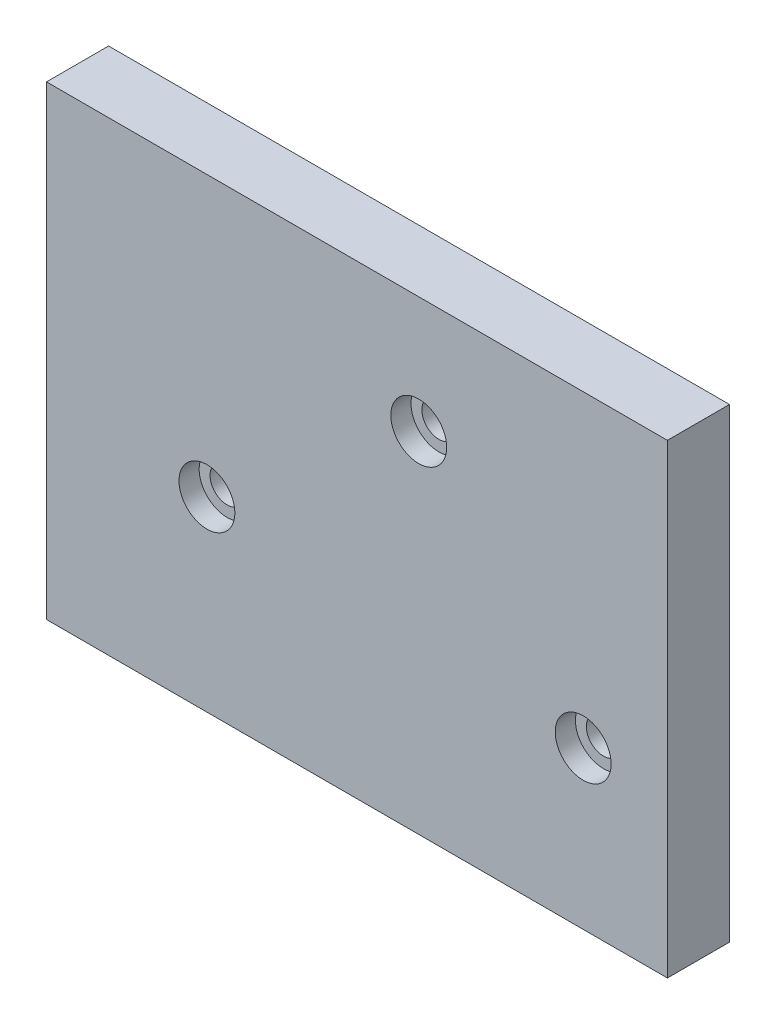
from build123d import *

# Parameters (mm, degrees)
SKIZZE1_W                                            = 200
SKIZZE1_H                                            = 150
LINEAR_AUSTRAGEN1_DEPTH                              = 20
STIRNSENKUNG_F_R_M10_ZYLINDERSCHRAUBE_MI_D           = 11
STIRNSENKUNG_F_R_M10_ZYLINDERSCHRAUBE_MI_CBORE_D     = 18
STIRNSENKUNG_F_R_M10_ZYLINDERSCHRAUBE_MI_CBORE_DEPTH = 6.5


with BuildPart() as part:
    # Skizze1 → Linear austragen1 (new body)
    with BuildSketch(Plane.XY):
        Rectangle(SKIZZE1_W, SKIZZE1_H)
    extrude(amount=LINEAR_AUSTRAGEN1_DEPTH)

    # Stirnsenkung f_r M10 Zylinderschraube mi (through all)
    with Locations(Plane.XY.offset(20)):
        with Locations((-48.330756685, -14.940951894), (19.90302759, 37.463052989), (72.870582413, -24.400723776)):
            CounterBoreHole(STIRNSENKUNG_F_R_M10_ZYLINDERSCHRAUBE_MI_D / 2, STIRNSENKUNG_F_R_M10_ZYLINDERSCHRAUBE_MI_CBORE_D / 2, STIRNSENKUNG_F_R_M10_ZYLINDERSCHRAUBE_MI_CBORE_DEPTH)


solid = part.part
